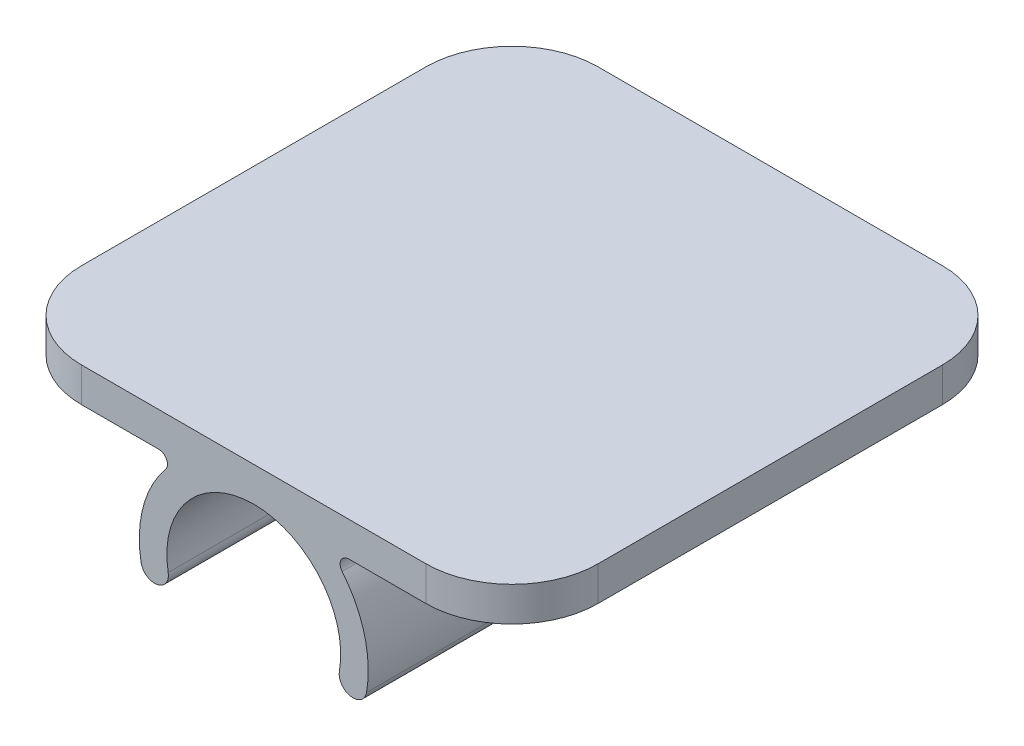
ISO-10303-21;
HEADER;
FILE_DESCRIPTION(('STEP AP214'),'2;1');
FILE_NAME('part.step','',(''),(''),'','','');
FILE_SCHEMA(('AUTOMOTIVE_DESIGN { 1 0 10303 214 1 1 1 1 }'));
ENDSEC;
DATA;
#1=APPLICATION_CONTEXT('core data for automotive mechanical design processes');
#2=APPLICATION_PROTOCOL_DEFINITION('international standard','automotive_design',2000,#1);
#3=PRODUCT_CONTEXT('',#1,'mechanical');
#4=PRODUCT('Part','Part','',(#3));
#5=PRODUCT_RELATED_PRODUCT_CATEGORY('part','',(#4));
#6=PRODUCT_DEFINITION_FORMATION('','',#4);
#7=PRODUCT_DEFINITION_CONTEXT('part definition',#1,'design');
#8=PRODUCT_DEFINITION('design','',#6,#7);
#9=PRODUCT_DEFINITION_SHAPE('','',#8);
#10=(LENGTH_UNIT() NAMED_UNIT(*) SI_UNIT(.MILLI.,.METRE.));
#11=(NAMED_UNIT(*) PLANE_ANGLE_UNIT() SI_UNIT($,.RADIAN.));
#12=(NAMED_UNIT(*) SI_UNIT($,.STERADIAN.) SOLID_ANGLE_UNIT());
#13=UNCERTAINTY_MEASURE_WITH_UNIT(LENGTH_MEASURE(1.E-05),#10,'distance_accuracy_value','');
#14=(GEOMETRIC_REPRESENTATION_CONTEXT(3) GLOBAL_UNCERTAINTY_ASSIGNED_CONTEXT((#13)) GLOBAL_UNIT_ASSIGNED_CONTEXT((#10,
#11,#12)) REPRESENTATION_CONTEXT('',''));
#15=CARTESIAN_POINT('',(0.,0.,0.));
#16=DIRECTION('',(0.,0.,1.));
#17=DIRECTION('',(1.,0.,0.));
#18=AXIS2_PLACEMENT_3D('',#15,#16,#17);
#19=CARTESIAN_POINT('',(-7.004599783,5.7785,19.05));
#20=DIRECTION('',(0.,0.,-1.));
#21=DIRECTION('',(-1.,0.,0.));
#22=AXIS2_PLACEMENT_3D('',#19,#20,#21);
#23=CYLINDRICAL_SURFACE('',#22,0.635);
#24=CARTESIAN_POINT('',(-7.004599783,5.7785,19.05));
#25=DIRECTION('',(0.,0.,-1.));
#26=DIRECTION('',(-1.,0.,0.));
#27=AXIS2_PLACEMENT_3D('',#24,#25,#26);
#28=CIRCLE('',#27,0.635);
#29=CARTESIAN_POINT('',(-6.51476762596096,5.37440909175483,19.05));
#30=VERTEX_POINT('',#29);
#31=CARTESIAN_POINT('',(-7.004599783,6.41349999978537,19.05));
#32=VERTEX_POINT('',#31);
#33=EDGE_CURVE('E168',#30,#32,#28,.F.);
#34=ORIENTED_EDGE('',*,*,#33,.T.);
#35=DIRECTION('',(0.,0.,-1.));
#36=VECTOR('',#35,1.);
#37=CARTESIAN_POINT('',(-7.004599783,6.4135,0.));
#38=LINE('',#37,#36);
#39=CARTESIAN_POINT('',(-7.004599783,6.41349999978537,-19.05));
#40=VERTEX_POINT('',#39);
#41=EDGE_CURVE('E249',#32,#40,#38,.T.);
#42=ORIENTED_EDGE('',*,*,#41,.T.);
#43=CARTESIAN_POINT('',(-7.004599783,5.7785,-19.05));
#44=DIRECTION('',(0.,0.,-1.));
#45=DIRECTION('',(-1.,0.,0.));
#46=AXIS2_PLACEMENT_3D('',#43,#44,#45);
#47=CIRCLE('',#46,0.635);
#48=CARTESIAN_POINT('',(-6.51476762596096,5.37440909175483,-19.05));
#49=VERTEX_POINT('',#48);
#50=EDGE_CURVE('E20',#40,#49,#47,.T.);
#51=ORIENTED_EDGE('',*,*,#50,.T.);
#52=DIRECTION('',(0.,0.,-1.));
#53=VECTOR('',#52,1.);
#54=CARTESIAN_POINT('',(-6.51476762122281,5.37440909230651,0.));
#55=LINE('',#54,#53);
#56=EDGE_CURVE('E269',#49,#30,#55,.F.);
#57=ORIENTED_EDGE('',*,*,#56,.T.);
#58=EDGE_LOOP('',(#34,#42,#51,#57));
#59=FACE_BOUND('',#58,.T.);
#60=ADVANCED_FACE('F16',(#59),#23,.F.);
#61=CARTESIAN_POINT('',(-19.05,6.4135,12.7));
#62=DIRECTION('',(1.,0.,0.));
#63=DIRECTION('',(0.,0.,-1.));
#64=AXIS2_PLACEMENT_3D('',#61,#62,#63);
#65=PLANE('',#64);
#66=DIRECTION('',(0.,-1.,0.));
#67=VECTOR('',#66,1.);
#68=CARTESIAN_POINT('',(-19.05,7.6835,12.7000000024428));
#69=LINE('',#68,#67);
#70=CARTESIAN_POINT('',(-19.05,6.4135,12.7000000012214));
#71=VERTEX_POINT('',#70);
#72=CARTESIAN_POINT('',(-19.05,8.9535,12.7000000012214));
#73=VERTEX_POINT('',#72);
#74=EDGE_CURVE('E240',#71,#73,#69,.F.);
#75=ORIENTED_EDGE('',*,*,#74,.T.);
#76=DIRECTION('',(0.,0.,-1.));
#77=VECTOR('',#76,1.);
#78=CARTESIAN_POINT('',(-19.05,8.9535,0.));
#79=LINE('',#78,#77);
#80=CARTESIAN_POINT('',(-19.05,8.9535,-12.7000000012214));
#81=VERTEX_POINT('',#80);
#82=EDGE_CURVE('E236',#73,#81,#79,.T.);
#83=ORIENTED_EDGE('',*,*,#82,.T.);
#84=DIRECTION('',(0.,1.,0.));
#85=VECTOR('',#84,1.);
#86=CARTESIAN_POINT('',(-19.05,7.6835,-12.7000000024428));
#87=LINE('',#86,#85);
#88=CARTESIAN_POINT('',(-19.05,6.4135,-12.7000000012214));
#89=VERTEX_POINT('',#88);
#90=EDGE_CURVE('E171',#81,#89,#87,.F.);
#91=ORIENTED_EDGE('',*,*,#90,.T.);
#92=DIRECTION('',(0.,0.,1.));
#93=VECTOR('',#92,1.);
#94=CARTESIAN_POINT('',(-19.05,6.4135,0.));
#95=LINE('',#94,#93);
#96=EDGE_CURVE('E245',#89,#71,#95,.T.);
#97=ORIENTED_EDGE('',*,*,#96,.T.);
#98=EDGE_LOOP('',(#75,#83,#91,#97));
#99=FACE_BOUND('',#98,.T.);
#100=ADVANCED_FACE('F282',(#99),#65,.F.);
#101=CARTESIAN_POINT('',(-12.7,6.4135,-12.7));
#102=DIRECTION('',(0.,1.,0.));
#103=DIRECTION('',(0.,0.,1.));
#104=AXIS2_PLACEMENT_3D('',#101,#102,#103);
#105=CYLINDRICAL_SURFACE('',#104,6.35);
#106=DIRECTION('',(0.,1.,0.));
#107=VECTOR('',#106,1.);
#108=CARTESIAN_POINT('',(-12.7,3.2899115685,-19.05));
#109=LINE('',#108,#107);
#110=CARTESIAN_POINT('',(-12.7,6.41349999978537,-19.05));
#111=VERTEX_POINT('',#110);
#112=CARTESIAN_POINT('',(-12.7,8.9535,-19.05));
#113=VERTEX_POINT('',#112);
#114=EDGE_CURVE('E215',#111,#113,#109,.T.);
#115=ORIENTED_EDGE('',*,*,#114,.F.);
#116=CARTESIAN_POINT('',(-12.7,6.4135,-12.7));
#117=DIRECTION('',(0.,1.,0.));
#118=DIRECTION('',(0.,0.,1.));
#119=AXIS2_PLACEMENT_3D('',#116,#117,#118);
#120=CIRCLE('',#119,6.35);
#121=EDGE_CURVE('E246',#111,#89,#120,.T.);
#122=ORIENTED_EDGE('',*,*,#121,.T.);
#123=ORIENTED_EDGE('',*,*,#90,.F.);
#124=CARTESIAN_POINT('',(-12.7,8.9535,-12.7));
#125=DIRECTION('',(0.,1.,0.));
#126=DIRECTION('',(0.,0.,1.));
#127=AXIS2_PLACEMENT_3D('',#124,#125,#126);
#128=CIRCLE('',#127,6.35);
#129=EDGE_CURVE('E237',#81,#113,#128,.F.);
#130=ORIENTED_EDGE('',*,*,#129,.T.);
#131=EDGE_LOOP('',(#115,#122,#123,#130));
#132=FACE_BOUND('',#131,.T.);
#133=ADVANCED_FACE('F388',(#132),#105,.T.);
#134=CARTESIAN_POINT('',(7.3166292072,-1.2901191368,19.05));
#135=DIRECTION('',(0.,0.,-1.));
#136=DIRECTION('',(-1.,0.,0.));
#137=AXIS2_PLACEMENT_3D('',#134,#135,#136);
#138=CYLINDRICAL_SURFACE('',#137,1.016);
#139=CARTESIAN_POINT('',(7.3166292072,-1.2901191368,19.05));
#140=DIRECTION('',(0.,0.,-1.));
#141=DIRECTION('',(-1.,0.,0.));
#142=AXIS2_PLACEMENT_3D('',#139,#140,#141);
#143=CIRCLE('',#142,1.016);
#144=CARTESIAN_POINT('',(8.3171938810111,-1.46654568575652,19.05));
#145=VERTEX_POINT('',#144);
#146=CARTESIAN_POINT('',(6.31606452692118,-1.11369258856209,19.05));
#147=VERTEX_POINT('',#146);
#148=EDGE_CURVE('E131',#145,#147,#143,.T.);
#149=ORIENTED_EDGE('',*,*,#148,.T.);
#150=DIRECTION('',(0.,0.,-1.));
#151=VECTOR('',#150,1.);
#152=CARTESIAN_POINT('',(6.31606452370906,-1.11369258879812,0.));
#153=LINE('',#152,#151);
#154=CARTESIAN_POINT('',(6.31606452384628,-1.1136925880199,-19.05));
#155=VERTEX_POINT('',#154);
#156=EDGE_CURVE('E154',#155,#147,#153,.F.);
#157=ORIENTED_EDGE('',*,*,#156,.F.);
#158=CARTESIAN_POINT('',(7.3166292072,-1.2901191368,-19.05));
#159=DIRECTION('',(0.,0.,-1.));
#160=DIRECTION('',(-1.,0.,0.));
#161=AXIS2_PLACEMENT_3D('',#158,#159,#160);
#162=CIRCLE('',#161,1.016);
#163=CARTESIAN_POINT('',(8.31719387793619,-1.46654568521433,-19.05));
#164=VERTEX_POINT('',#163);
#165=EDGE_CURVE('E140',#164,#155,#162,.T.);
#166=ORIENTED_EDGE('',*,*,#165,.F.);
#167=DIRECTION('',(0.,0.,-1.));
#168=VECTOR('',#167,1.);
#169=CARTESIAN_POINT('',(8.3171938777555,-1.4665456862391,0.));
#170=LINE('',#169,#168);
#171=EDGE_CURVE('E231',#164,#145,#170,.F.);
#172=ORIENTED_EDGE('',*,*,#171,.T.);
#173=EDGE_LOOP('',(#149,#157,#166,#172));
#174=FACE_BOUND('',#173,.T.);
#175=ADVANCED_FACE('F161',(#174),#138,.T.);
#176=CARTESIAN_POINT('',(0.,0.,19.05));
#177=DIRECTION('',(0.,0.,-1.));
#178=DIRECTION('',(-1.,0.,0.));
#179=AXIS2_PLACEMENT_3D('',#176,#177,#178);
#180=CYLINDRICAL_SURFACE('',#179,6.4135);
#181=CARTESIAN_POINT('',(0.,0.,19.05));
#182=DIRECTION('',(0.,0.,-1.));
#183=DIRECTION('',(-1.,0.,0.));
#184=AXIS2_PLACEMENT_3D('',#181,#182,#183);
#185=CIRCLE('',#184,6.4135);
#186=CARTESIAN_POINT('',(-6.31606452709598,-1.11369258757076,19.05));
#187=VERTEX_POINT('',#186);
#188=EDGE_CURVE('E206',#147,#187,#185,.F.);
#189=ORIENTED_EDGE('',*,*,#188,.T.);
#190=DIRECTION('',(0.,0.,1.));
#191=VECTOR('',#190,1.);
#192=CARTESIAN_POINT('',(-6.31606453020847,-1.11369258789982,0.));
#193=LINE('',#192,#191);
#194=CARTESIAN_POINT('',(-6.31606452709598,-1.11369258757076,-19.05));
#195=VERTEX_POINT('',#194);
#196=EDGE_CURVE('E156',#187,#195,#193,.F.);
#197=ORIENTED_EDGE('',*,*,#196,.T.);
#198=CARTESIAN_POINT('',(0.,0.,-19.05));
#199=DIRECTION('',(0.,0.,-1.));
#200=DIRECTION('',(-1.,0.,0.));
#201=AXIS2_PLACEMENT_3D('',#198,#199,#200);
#202=CIRCLE('',#201,6.4135);
#203=EDGE_CURVE('E145',#155,#195,#202,.F.);
#204=ORIENTED_EDGE('',*,*,#203,.F.);
#205=ORIENTED_EDGE('',*,*,#156,.T.);
#206=EDGE_LOOP('',(#189,#197,#204,#205));
#207=FACE_BOUND('',#206,.T.);
#208=ADVANCED_FACE('F153',(#207),#180,.F.);
#209=CARTESIAN_POINT('',(-7.3166292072,-1.2901191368,19.05));
#210=DIRECTION('',(0.,0.,-1.));
#211=DIRECTION('',(-1.,0.,0.));
#212=AXIS2_PLACEMENT_3D('',#209,#210,#211);
#213=CYLINDRICAL_SURFACE('',#212,1.016);
#214=ORIENTED_EDGE('',*,*,#196,.F.);
#215=CARTESIAN_POINT('',(-7.3166292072,-1.2901191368,19.05));
#216=DIRECTION('',(0.,0.,-1.));
#217=DIRECTION('',(-1.,0.,0.));
#218=AXIS2_PLACEMENT_3D('',#215,#216,#217);
#219=CIRCLE('',#218,1.016);
#220=CARTESIAN_POINT('',(-8.3171938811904,-1.46654568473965,19.05));
#221=VERTEX_POINT('',#220);
#222=EDGE_CURVE('E202',#187,#221,#219,.T.);
#223=ORIENTED_EDGE('',*,*,#222,.T.);
#224=DIRECTION('',(0.,0.,-1.));
#225=VECTOR('',#224,1.);
#226=CARTESIAN_POINT('',(-8.31719388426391,-1.46654568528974,0.));
#227=LINE('',#226,#225);
#228=CARTESIAN_POINT('',(-8.3171938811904,-1.46654568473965,-19.05));
#229=VERTEX_POINT('',#228);
#230=EDGE_CURVE('E257',#229,#221,#227,.F.);
#231=ORIENTED_EDGE('',*,*,#230,.F.);
#232=CARTESIAN_POINT('',(-7.3166292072,-1.2901191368,-19.05));
#233=DIRECTION('',(0.,0.,-1.));
#234=DIRECTION('',(-1.,0.,0.));
#235=AXIS2_PLACEMENT_3D('',#232,#233,#234);
#236=CIRCLE('',#235,1.016);
#237=EDGE_CURVE('E159',#195,#229,#236,.T.);
#238=ORIENTED_EDGE('',*,*,#237,.F.);
#239=EDGE_LOOP('',(#214,#223,#231,#238));
#240=FACE_BOUND('',#239,.T.);
#241=ADVANCED_FACE('F418',(#240),#213,.T.);
#242=CARTESIAN_POINT('',(0.,0.,19.05));
#243=DIRECTION('',(0.,0.,-1.));
#244=DIRECTION('',(-1.,0.,0.));
#245=AXIS2_PLACEMENT_3D('',#242,#243,#244);
#246=CYLINDRICAL_SURFACE('',#245,8.4455);
#247=CARTESIAN_POINT('',(0.,0.,19.05));
#248=DIRECTION('',(0.,0.,-1.));
#249=DIRECTION('',(-1.,0.,0.));
#250=AXIS2_PLACEMENT_3D('',#247,#248,#249);
#251=CIRCLE('',#250,8.4455);
#252=EDGE_CURVE('E197',#221,#30,#251,.T.);
#253=ORIENTED_EDGE('',*,*,#252,.T.);
#254=ORIENTED_EDGE('',*,*,#56,.F.);
#255=CARTESIAN_POINT('',(0.,0.,-19.05));
#256=DIRECTION('',(0.,0.,-1.));
#257=DIRECTION('',(-1.,0.,0.));
#258=AXIS2_PLACEMENT_3D('',#255,#256,#257);
#259=CIRCLE('',#258,8.4455);
#260=EDGE_CURVE('E216',#229,#49,#259,.T.);
#261=ORIENTED_EDGE('',*,*,#260,.F.);
#262=ORIENTED_EDGE('',*,*,#230,.T.);
#263=EDGE_LOOP('',(#253,#254,#261,#262));
#264=FACE_BOUND('',#263,.T.);
#265=ADVANCED_FACE('F310',(#264),#246,.T.);
#266=CARTESIAN_POINT('',(-19.05,6.4135,-19.05));
#267=DIRECTION('',(0.,1.,0.));
#268=DIRECTION('',(0.,0.,1.));
#269=AXIS2_PLACEMENT_3D('',#266,#267,#268);
#270=PLANE('',#269);
#271=CARTESIAN_POINT('',(-12.7,6.4135,12.7));
#272=DIRECTION('',(0.,-1.,0.));
#273=DIRECTION('',(1.,0.,0.));
#274=AXIS2_PLACEMENT_3D('',#271,#272,#273);
#275=CIRCLE('',#274,6.35);
#276=CARTESIAN_POINT('',(-12.7,6.41349999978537,19.05));
#277=VERTEX_POINT('',#276);
#278=EDGE_CURVE('E241',#277,#71,#275,.T.);
#279=ORIENTED_EDGE('',*,*,#278,.T.);
#280=ORIENTED_EDGE('',*,*,#96,.F.);
#281=ORIENTED_EDGE('',*,*,#121,.F.);
#282=DIRECTION('',(-1.,0.,0.));
#283=VECTOR('',#282,1.);
#284=CARTESIAN_POINT('',(0.,6.41349999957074,-19.05));
#285=LINE('',#284,#283);
#286=EDGE_CURVE('E220',#40,#111,#285,.T.);
#287=ORIENTED_EDGE('',*,*,#286,.F.);
#288=ORIENTED_EDGE('',*,*,#41,.F.);
#289=DIRECTION('',(-1.,0.,0.));
#290=VECTOR('',#289,1.);
#291=CARTESIAN_POINT('',(0.,6.41349999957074,19.05));
#292=LINE('',#291,#290);
#293=EDGE_CURVE('E201',#32,#277,#292,.T.);
#294=ORIENTED_EDGE('',*,*,#293,.T.);
#295=EDGE_LOOP('',(#279,#280,#281,#287,#288,#294));
#296=FACE_BOUND('',#295,.T.);
#297=ADVANCED_FACE('F314',(#296),#270,.F.);
#298=CARTESIAN_POINT('',(-12.7,8.9535,12.7));
#299=DIRECTION('',(0.,-1.,0.));
#300=DIRECTION('',(1.,0.,0.));
#301=AXIS2_PLACEMENT_3D('',#298,#299,#300);
#302=CYLINDRICAL_SURFACE('',#301,6.35);
#303=ORIENTED_EDGE('',*,*,#74,.F.);
#304=ORIENTED_EDGE('',*,*,#278,.F.);
#305=DIRECTION('',(0.,1.,0.));
#306=VECTOR('',#305,1.);
#307=CARTESIAN_POINT('',(-12.7,3.2899115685,19.05));
#308=LINE('',#307,#306);
#309=CARTESIAN_POINT('',(-12.7,8.9535,19.05));
#310=VERTEX_POINT('',#309);
#311=EDGE_CURVE('E294',#277,#310,#308,.T.);
#312=ORIENTED_EDGE('',*,*,#311,.T.);
#313=CARTESIAN_POINT('',(-12.7,8.9535,12.7));
#314=DIRECTION('',(0.,-1.,0.));
#315=DIRECTION('',(1.,0.,0.));
#316=AXIS2_PLACEMENT_3D('',#313,#314,#315);
#317=CIRCLE('',#316,6.35);
#318=EDGE_CURVE('E232',#310,#73,#317,.T.);
#319=ORIENTED_EDGE('',*,*,#318,.T.);
#320=EDGE_LOOP('',(#303,#304,#312,#319));
#321=FACE_BOUND('',#320,.T.);
#322=ADVANCED_FACE('F292',(#321),#302,.T.);
#323=CARTESIAN_POINT('',(-19.05,8.9535,19.05));
#324=DIRECTION('',(0.,-1.,0.));
#325=DIRECTION('',(0.,0.,-1.));
#326=AXIS2_PLACEMENT_3D('',#323,#324,#325);
#327=PLANE('',#326);
#328=ORIENTED_EDGE('',*,*,#318,.F.);
#329=DIRECTION('',(1.,0.,0.));
#330=VECTOR('',#329,1.);
#331=CARTESIAN_POINT('',(0.,8.9535,19.05));
#332=LINE('',#331,#330);
#333=CARTESIAN_POINT('',(12.7,8.9535,19.05));
#334=VERTEX_POINT('',#333);
#335=EDGE_CURVE('E299',#310,#334,#332,.T.);
#336=ORIENTED_EDGE('',*,*,#335,.T.);
#337=CARTESIAN_POINT('',(12.7,8.9535,12.7));
#338=DIRECTION('',(0.,1.,0.));
#339=DIRECTION('',(0.,0.,1.));
#340=AXIS2_PLACEMENT_3D('',#337,#338,#339);
#341=CIRCLE('',#340,6.35);
#342=CARTESIAN_POINT('',(19.05,8.9535,12.7));
#343=VERTEX_POINT('',#342);
#344=EDGE_CURVE('E191',#334,#343,#341,.T.);
#345=ORIENTED_EDGE('',*,*,#344,.T.);
#346=DIRECTION('',(0.,0.,-1.));
#347=VECTOR('',#346,1.);
#348=CARTESIAN_POINT('',(19.05,8.9535,0.));
#349=LINE('',#348,#347);
#350=CARTESIAN_POINT('',(19.05,8.9535,-12.7));
#351=VERTEX_POINT('',#350);
#352=EDGE_CURVE('E190',#343,#351,#349,.T.);
#353=ORIENTED_EDGE('',*,*,#352,.T.);
#354=CARTESIAN_POINT('',(12.7,8.9535,-12.7));
#355=DIRECTION('',(0.,-1.,0.));
#356=DIRECTION('',(1.,0.,0.));
#357=AXIS2_PLACEMENT_3D('',#354,#355,#356);
#358=CIRCLE('',#357,6.35);
#359=CARTESIAN_POINT('',(12.7,8.9535,-19.05));
#360=VERTEX_POINT('',#359);
#361=EDGE_CURVE('E226',#351,#360,#358,.F.);
#362=ORIENTED_EDGE('',*,*,#361,.T.);
#363=DIRECTION('',(1.,0.,0.));
#364=VECTOR('',#363,1.);
#365=CARTESIAN_POINT('',(0.,8.9535,-19.05));
#366=LINE('',#365,#364);
#367=EDGE_CURVE('E230',#113,#360,#366,.T.);
#368=ORIENTED_EDGE('',*,*,#367,.F.);
#369=ORIENTED_EDGE('',*,*,#129,.F.);
#370=ORIENTED_EDGE('',*,*,#82,.F.);
#371=EDGE_LOOP('',(#328,#336,#345,#353,#362,#368,#369,#370));
#372=FACE_BOUND('',#371,.T.);
#373=ADVANCED_FACE('F286',(#372),#327,.F.);
#374=CARTESIAN_POINT('',(0.,0.,19.05));
#375=DIRECTION('',(0.,0.,-1.));
#376=DIRECTION('',(-1.,0.,0.));
#377=AXIS2_PLACEMENT_3D('',#374,#375,#376);
#378=CYLINDRICAL_SURFACE('',#377,8.4455);
#379=DIRECTION('',(0.,0.,1.));
#380=VECTOR('',#379,1.);
#381=CARTESIAN_POINT('',(6.51476763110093,5.37440909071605,0.));
#382=LINE('',#381,#380);
#383=CARTESIAN_POINT('',(6.51476762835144,5.37440908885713,19.05));
#384=VERTEX_POINT('',#383);
#385=CARTESIAN_POINT('',(6.51476762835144,5.37440908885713,-19.05));
#386=VERTEX_POINT('',#385);
#387=EDGE_CURVE('E185',#384,#386,#382,.F.);
#388=ORIENTED_EDGE('',*,*,#387,.F.);
#389=CARTESIAN_POINT('',(0.,0.,19.05));
#390=DIRECTION('',(0.,0.,-1.));
#391=DIRECTION('',(-1.,0.,0.));
#392=AXIS2_PLACEMENT_3D('',#389,#390,#391);
#393=CIRCLE('',#392,8.4455);
#394=EDGE_CURVE('E211',#384,#145,#393,.T.);
#395=ORIENTED_EDGE('',*,*,#394,.T.);
#396=ORIENTED_EDGE('',*,*,#171,.F.);
#397=CARTESIAN_POINT('',(0.,0.,-19.05));
#398=DIRECTION('',(0.,0.,-1.));
#399=DIRECTION('',(-1.,0.,0.));
#400=AXIS2_PLACEMENT_3D('',#397,#398,#399);
#401=CIRCLE('',#400,8.4455);
#402=EDGE_CURVE('E148',#386,#164,#401,.T.);
#403=ORIENTED_EDGE('',*,*,#402,.F.);
#404=EDGE_LOOP('',(#388,#395,#396,#403));
#405=FACE_BOUND('',#404,.T.);
#406=ADVANCED_FACE('F374',(#405),#378,.T.);
#407=CARTESIAN_POINT('',(12.7,8.9535,-12.7));
#408=DIRECTION('',(0.,-1.,0.));
#409=DIRECTION('',(1.,0.,0.));
#410=AXIS2_PLACEMENT_3D('',#407,#408,#409);
#411=CYLINDRICAL_SURFACE('',#410,6.35);
#412=DIRECTION('',(0.,-1.,0.));
#413=VECTOR('',#412,1.);
#414=CARTESIAN_POINT('',(12.7,3.2899115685,-19.05));
#415=LINE('',#414,#413);
#416=CARTESIAN_POINT('',(12.7,6.4135,-19.05));
#417=VERTEX_POINT('',#416);
#418=EDGE_CURVE('E225',#360,#417,#415,.T.);
#419=ORIENTED_EDGE('',*,*,#418,.F.);
#420=ORIENTED_EDGE('',*,*,#361,.F.);
#421=DIRECTION('',(0.,-1.,0.));
#422=VECTOR('',#421,1.);
#423=CARTESIAN_POINT('',(19.05,7.6835,-12.7));
#424=LINE('',#423,#422);
#425=CARTESIAN_POINT('',(19.05,6.4135,-12.7));
#426=VERTEX_POINT('',#425);
#427=EDGE_CURVE('E195',#351,#426,#424,.T.);
#428=ORIENTED_EDGE('',*,*,#427,.T.);
#429=CARTESIAN_POINT('',(12.7,6.4135,-12.7));
#430=DIRECTION('',(0.,-1.,0.));
#431=DIRECTION('',(1.,0.,0.));
#432=AXIS2_PLACEMENT_3D('',#429,#430,#431);
#433=CIRCLE('',#432,6.35);
#434=EDGE_CURVE('E178',#426,#417,#433,.F.);
#435=ORIENTED_EDGE('',*,*,#434,.T.);
#436=EDGE_LOOP('',(#419,#420,#428,#435));
#437=FACE_BOUND('',#436,.T.);
#438=ADVANCED_FACE('F386',(#437),#411,.T.);
#439=CARTESIAN_POINT('',(12.7,-2.373676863,-19.05));
#440=DIRECTION('',(0.,0.,-1.));
#441=DIRECTION('',(-1.,0.,0.));
#442=AXIS2_PLACEMENT_3D('',#439,#440,#441);
#443=PLANE('',#442);
#444=ORIENTED_EDGE('',*,*,#286,.T.);
#445=ORIENTED_EDGE('',*,*,#114,.T.);
#446=ORIENTED_EDGE('',*,*,#367,.T.);
#447=ORIENTED_EDGE('',*,*,#418,.T.);
#448=DIRECTION('',(-1.,0.,0.));
#449=VECTOR('',#448,1.);
#450=CARTESIAN_POINT('',(13.0272998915,6.4135,-19.05));
#451=LINE('',#450,#449);
#452=CARTESIAN_POINT('',(7.00459978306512,6.4135,-19.05));
#453=VERTEX_POINT('',#452);
#454=EDGE_CURVE('E182',#417,#453,#451,.T.);
#455=ORIENTED_EDGE('',*,*,#454,.T.);
#456=CARTESIAN_POINT('',(7.004599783,5.7785,-19.05));
#457=DIRECTION('',(0.,0.,-1.));
#458=DIRECTION('',(-1.,0.,0.));
#459=AXIS2_PLACEMENT_3D('',#456,#457,#458);
#460=CIRCLE('',#459,0.635000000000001);
#461=EDGE_CURVE('E39',#386,#453,#460,.T.);
#462=ORIENTED_EDGE('',*,*,#461,.F.);
#463=ORIENTED_EDGE('',*,*,#402,.T.);
#464=ORIENTED_EDGE('',*,*,#165,.T.);
#465=ORIENTED_EDGE('',*,*,#203,.T.);
#466=ORIENTED_EDGE('',*,*,#237,.T.);
#467=ORIENTED_EDGE('',*,*,#260,.T.);
#468=ORIENTED_EDGE('',*,*,#50,.F.);
#469=EDGE_LOOP('',(#444,#445,#446,#447,#455,#462,#463,#464,#465,#466,#467,#468));
#470=FACE_BOUND('',#469,.T.);
#471=ADVANCED_FACE('F143',(#470),#443,.T.);
#472=CARTESIAN_POINT('',(12.7,-2.373676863,19.05));
#473=DIRECTION('',(0.,0.,-1.));
#474=DIRECTION('',(-1.,0.,0.));
#475=AXIS2_PLACEMENT_3D('',#472,#473,#474);
#476=PLANE('',#475);
#477=ORIENTED_EDGE('',*,*,#335,.F.);
#478=ORIENTED_EDGE('',*,*,#311,.F.);
#479=ORIENTED_EDGE('',*,*,#293,.F.);
#480=ORIENTED_EDGE('',*,*,#33,.F.);
#481=ORIENTED_EDGE('',*,*,#252,.F.);
#482=ORIENTED_EDGE('',*,*,#222,.F.);
#483=ORIENTED_EDGE('',*,*,#188,.F.);
#484=ORIENTED_EDGE('',*,*,#148,.F.);
#485=ORIENTED_EDGE('',*,*,#394,.F.);
#486=CARTESIAN_POINT('',(7.004599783,5.7785,19.05));
#487=DIRECTION('',(0.,0.,-1.));
#488=DIRECTION('',(-1.,0.,0.));
#489=AXIS2_PLACEMENT_3D('',#486,#487,#488);
#490=CIRCLE('',#489,0.635000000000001);
#491=CARTESIAN_POINT('',(7.00459978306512,6.4135,19.05));
#492=VERTEX_POINT('',#491);
#493=EDGE_CURVE('E186',#492,#384,#490,.F.);
#494=ORIENTED_EDGE('',*,*,#493,.F.);
#495=DIRECTION('',(1.,0.,0.));
#496=VECTOR('',#495,1.);
#497=CARTESIAN_POINT('',(13.0272998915,6.4135,19.05));
#498=LINE('',#497,#496);
#499=CARTESIAN_POINT('',(12.7,6.4135,19.05));
#500=VERTEX_POINT('',#499);
#501=EDGE_CURVE('E177',#492,#500,#498,.T.);
#502=ORIENTED_EDGE('',*,*,#501,.T.);
#503=DIRECTION('',(0.,-1.,0.));
#504=VECTOR('',#503,1.);
#505=CARTESIAN_POINT('',(12.7,7.6835,19.05));
#506=LINE('',#505,#504);
#507=EDGE_CURVE('E196',#500,#334,#506,.F.);
#508=ORIENTED_EDGE('',*,*,#507,.T.);
#509=EDGE_LOOP('',(#477,#478,#479,#480,#481,#482,#483,#484,#485,#494,#502,#508));
#510=FACE_BOUND('',#509,.T.);
#511=ADVANCED_FACE('F312',(#510),#476,.F.);
#512=CARTESIAN_POINT('',(12.7,6.4135,12.7));
#513=DIRECTION('',(0.,1.,0.));
#514=DIRECTION('',(0.,0.,1.));
#515=AXIS2_PLACEMENT_3D('',#512,#513,#514);
#516=CYLINDRICAL_SURFACE('',#515,6.35);
#517=DIRECTION('',(0.,1.,0.));
#518=VECTOR('',#517,1.);
#519=CARTESIAN_POINT('',(19.05,7.6835,12.7));
#520=LINE('',#519,#518);
#521=CARTESIAN_POINT('',(19.05,6.4135,12.7));
#522=VERTEX_POINT('',#521);
#523=EDGE_CURVE('E324',#522,#343,#520,.T.);
#524=ORIENTED_EDGE('',*,*,#523,.T.);
#525=ORIENTED_EDGE('',*,*,#344,.F.);
#526=ORIENTED_EDGE('',*,*,#507,.F.);
#527=CARTESIAN_POINT('',(12.7,6.4135,12.7));
#528=DIRECTION('',(0.,1.,0.));
#529=DIRECTION('',(0.,0.,1.));
#530=AXIS2_PLACEMENT_3D('',#527,#528,#529);
#531=CIRCLE('',#530,6.35);
#532=EDGE_CURVE('E173',#500,#522,#531,.T.);
#533=ORIENTED_EDGE('',*,*,#532,.T.);
#534=EDGE_LOOP('',(#524,#525,#526,#533));
#535=FACE_BOUND('',#534,.T.);
#536=ADVANCED_FACE('F348',(#535),#516,.T.);
#537=CARTESIAN_POINT('',(19.05,6.4135,-12.7));
#538=DIRECTION('',(-1.,0.,0.));
#539=DIRECTION('',(0.,0.,1.));
#540=AXIS2_PLACEMENT_3D('',#537,#538,#539);
#541=PLANE('',#540);
#542=ORIENTED_EDGE('',*,*,#523,.F.);
#543=DIRECTION('',(0.,0.,-1.));
#544=VECTOR('',#543,1.);
#545=CARTESIAN_POINT('',(19.05,6.4135,0.));
#546=LINE('',#545,#544);
#547=EDGE_CURVE('E27',#522,#426,#546,.T.);
#548=ORIENTED_EDGE('',*,*,#547,.T.);
#549=ORIENTED_EDGE('',*,*,#427,.F.);
#550=ORIENTED_EDGE('',*,*,#352,.F.);
#551=EDGE_LOOP('',(#542,#548,#549,#550));
#552=FACE_BOUND('',#551,.T.);
#553=ADVANCED_FACE('F384',(#552),#541,.F.);
#554=CARTESIAN_POINT('',(19.05,6.4135,-19.05));
#555=DIRECTION('',(0.,1.,0.));
#556=DIRECTION('',(-1.,0.,0.));
#557=AXIS2_PLACEMENT_3D('',#554,#555,#556);
#558=PLANE('',#557);
#559=ORIENTED_EDGE('',*,*,#532,.F.);
#560=ORIENTED_EDGE('',*,*,#501,.F.);
#561=DIRECTION('',(0.,0.,-1.));
#562=VECTOR('',#561,1.);
#563=CARTESIAN_POINT('',(7.00459978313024,6.4135,0.));
#564=LINE('',#563,#562);
#565=EDGE_CURVE('E11',#453,#492,#564,.F.);
#566=ORIENTED_EDGE('',*,*,#565,.F.);
#567=ORIENTED_EDGE('',*,*,#454,.F.);
#568=ORIENTED_EDGE('',*,*,#434,.F.);
#569=ORIENTED_EDGE('',*,*,#547,.F.);
#570=EDGE_LOOP('',(#559,#560,#566,#567,#568,#569));
#571=FACE_BOUND('',#570,.T.);
#572=ADVANCED_FACE('F18',(#571),#558,.F.);
#573=CARTESIAN_POINT('',(7.004599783,5.7785,19.05));
#574=DIRECTION('',(0.,0.,-1.));
#575=DIRECTION('',(-1.,0.,0.));
#576=AXIS2_PLACEMENT_3D('',#573,#574,#575);
#577=CYLINDRICAL_SURFACE('',#576,0.635000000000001);
#578=ORIENTED_EDGE('',*,*,#461,.T.);
#579=ORIENTED_EDGE('',*,*,#565,.T.);
#580=ORIENTED_EDGE('',*,*,#493,.T.);
#581=ORIENTED_EDGE('',*,*,#387,.T.);
#582=EDGE_LOOP('',(#578,#579,#580,#581));
#583=FACE_BOUND('',#582,.T.);
#584=ADVANCED_FACE('F367',(#583),#577,.F.);
#585=CLOSED_SHELL('',(#60,#100,#133,#175,#208,#241,#265,#297,#322,#373,#406,#438,#471,#511,#536,
#553,#572,#584));
#586=MANIFOLD_SOLID_BREP('B1',#585);
#587=ADVANCED_BREP_SHAPE_REPRESENTATION('',(#18,#586),#14);
#588=SHAPE_DEFINITION_REPRESENTATION(#9,#587);
ENDSEC;
END-ISO-10303-21;
